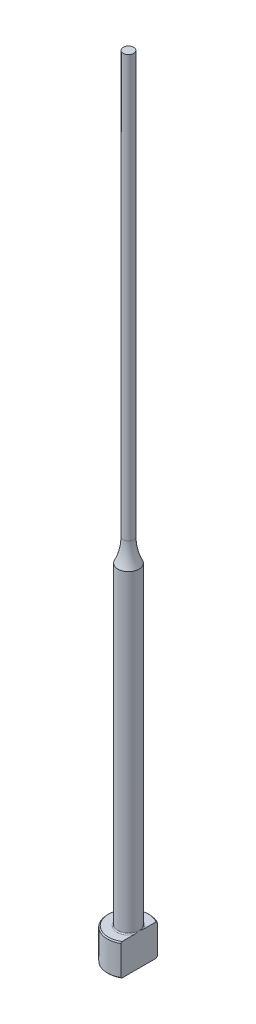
from build123d import *
from build123d.topology import SkipClean

# Parameters (mm, degrees)
CHAMFER1_SIZE    = 0.2
FILLET1_R        = 0.2
KEYED_HEAD_DEPTH = 151.106628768


with BuildPart() as part:
    # Sketch1 → Revolve1 (revolve)
    with BuildSketch(Plane.XY, mode=Mode.PRIVATE) as revolve1_sk:
        with BuildLine():
            Line((0, 0), (-4, 0))
            Line((-4, 0), (-4, 6))
            Line((-4, 6), (-2, 6))
            Line((-2, 6), (-2, 65.641101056))
            ThreePointArc((-2, 65.641101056), (-1.253205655, 67.763932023), (-1, 70))
            Line((-1, 70), (-1, 150))
            Line((-1, 150), (0, 150))
            Line((0, 150), (0, 0))
        make_face()
    revolve(revolve1_sk.sketch.rotate(Axis((0, 259.958771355, 0), (0, -1, 0)), 270), axis=Axis((0, 259.958771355, 0), (0, -1, 0)))

    # Chamfer1
    chamfer1_edges = [part.edges().sort_by_distance(p)[0] for p in [
        (0, 0, -4),
        (0, 6, -4),
    ]]
    chamfer(chamfer1_edges, length=CHAMFER1_SIZE)

    # Fillet1
    fillet1_edges = [part.edges().sort_by_distance(p)[0] for p in [
        (0, 6, -2),
    ]]
    fillet(fillet1_edges, radius=FILLET1_R)

    # Sketch2 → Keyed Head (cut, through all)
    with SkipClean():  # the faces are left unmerged after this step: merging them gives an invalid solid
        with BuildSketch(Plane(origin=(0, 0, 0), x_dir=(1, 0, 0), z_dir=(0, 1, 0))):
            with BuildLine():
                Line((2, -3.464101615), (2, 3.464101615))
                ThreePointArc((2, 3.464101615), (4, 0), (2, -3.464101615))
            make_face()
        extrude(amount=KEYED_HEAD_DEPTH, mode=Mode.SUBTRACT)


solid = part.part
